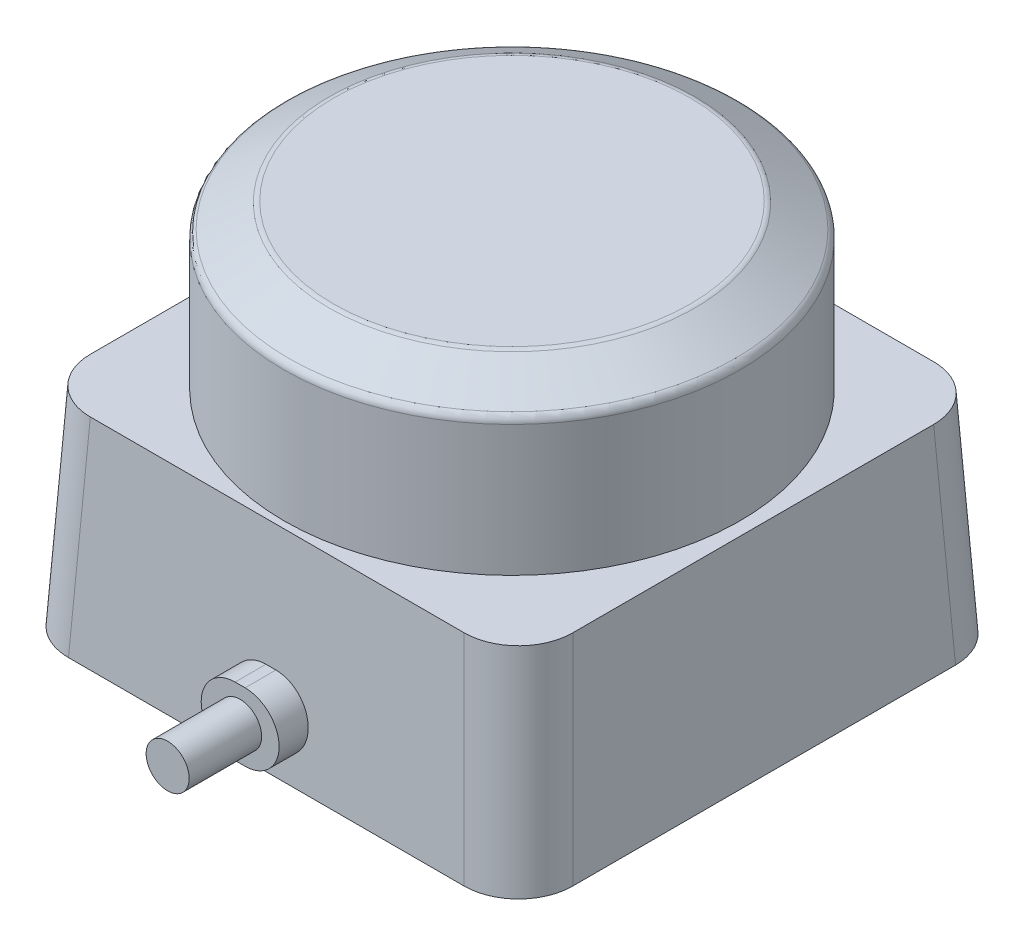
from build123d import *

# Parameters (mm, degrees)
SKETCH1_W           = 55.65
SKETCH1_H           = 54.22051571
BOSS_EXTRUDE1_DEPTH = 23
BOSS_EXTRUDE1_TAPER = 3
SKETCH2_R           = 25.15
BOSS_EXTRUDE2_DEPTH = 18
CHAMFER1_SIZE       = 3
CHAMFER1_SIZE2      = 5.196152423
BOSS_EXTRUDE3_DEPTH = 30
SKETCH4_R           = 2.375
BOSS_EXTRUDE4_DEPTH = 8
SKETCH5_R           = 1.25
CUT_EXTRUDE1_DEPTH  = 5
CHAMFER2_SIZE       = 0.2
CHAMFER2_SIZE2      = 0.346410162
FILLET1_R           = 6
FILLET2_R           = 1


with BuildPart() as part:
    # Sketch1 → Boss-Extrude1 (new body)
    with BuildSketch(Plane(origin=(0, 0, 0), x_dir=(1, 0, 0), z_dir=(0, 1, 0))):
        Rectangle(SKETCH1_W, SKETCH1_H)
    extrude(amount=BOSS_EXTRUDE1_DEPTH, taper=BOSS_EXTRUDE1_TAPER)

    # Sketch2 → Boss-Extrude2 (add)
    with BuildSketch(Plane(origin=(0, 23, 0), x_dir=(1, 0, 0), z_dir=(0, 1, 0))):
        with Locations(Location((0, 0, 0), (0, 0, 270))):
            Circle(SKETCH2_R)
    extrude(amount=BOSS_EXTRUDE2_DEPTH)

    # Chamfer1
    chamfer1_edges = [part.edges().sort_by_distance(p)[0] for p in [
        (0, 41, -25.15),
    ]]
    chamfer1_side = [part.faces().sort_by_distance(p)[0] for p in [
        (0, 32, -25.15),
    ]]
    chamfer(chamfer1_edges, length=CHAMFER1_SIZE, length2=CHAMFER1_SIZE2, reference=chamfer1_side[0])

    # Sketch3 → Boss-Extrude3 (add)
    with BuildSketch(Plane.XY):
        with BuildLine():
            Line((0.55, 2.25), (-0.55, 2.25))
            ThreePointArc((-0.55, 2.25), (-4.3, 6), (-0.55, 9.75))
            Line((-0.55, 9.75), (0.55, 9.75))
            ThreePointArc((0.55, 9.75), (4.3, 6), (0.55, 2.25))
        make_face()
    extrude(amount=BOSS_EXTRUDE3_DEPTH)

    # Sketch4 → Boss-Extrude4 (add)
    with BuildSketch(Plane.XY.offset(30)):
        with Locations((0, 6)):
            Circle(SKETCH4_R)
    extrude(amount=BOSS_EXTRUDE4_DEPTH)

    # Sketch5 → Cut-Extrude1 (cut)
    with BuildSketch(Plane.XZ):
        with Locations(Location((-21.4, 21.4, 0), (0, 0, 270))):
            Circle(SKETCH5_R)
        with Locations(Location((21.4, 21.4, 0), (0, 0, 270))):
            Circle(SKETCH5_R)
        with Locations(Location((21.4, -21.4, 0), (0, 0, 270))):
            Circle(SKETCH5_R)
        with Locations(Location((-21.4, -21.4, 0), (0, 0, 270))):
            Circle(SKETCH5_R)
    extrude(amount=-CUT_EXTRUDE1_DEPTH, mode=Mode.SUBTRACT)

    # Chamfer2
    chamfer2_edges = [part.edges().sort_by_distance(p)[0] for p in [
        (-21.4, 0, -20.15),
        (21.4, 0, -20.15),
        (21.4, 0, 22.65),
        (-21.4, 0, 22.65),
    ]]
    chamfer2_side = [part.faces().sort_by_distance(p)[0] for p in [
        (0, 0, 0),
    ]]
    chamfer(chamfer2_edges, length=CHAMFER2_SIZE, length2=CHAMFER2_SIZE2, reference=chamfer2_side[0])

    # Fillet1
    fillet1_edges = [part.edges().sort_by_distance(p)[0] for p in [
        (-27.222310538, 11.5, -26.507568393),
        (27.222310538, 11.5, -26.507568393),
        (27.222310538, 11.5, 26.507568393),
        (-27.222310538, 11.5, 26.507568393),
    ]]
    fillet(fillet1_edges, radius=FILLET1_R)

    # Fillet2
    fillet2_edges = [part.edges().sort_by_distance(p)[0] for p in [
        (0, 41, -19.953847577),
        (0, 38, -25.15),
    ]]
    fillet(fillet2_edges, radius=FILLET2_R)


solid = part.part
